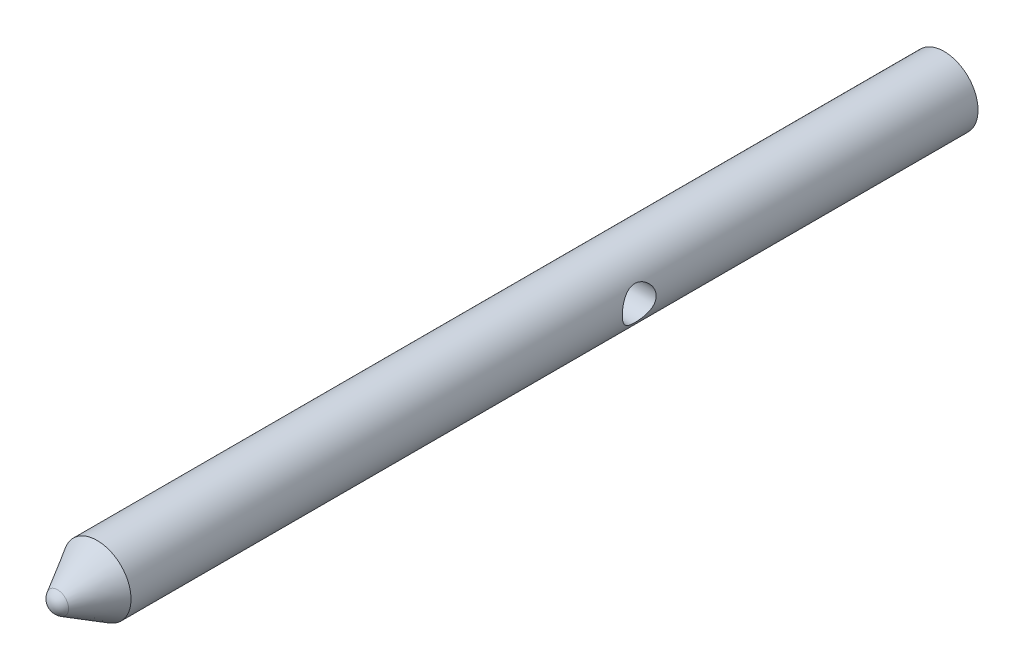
from build123d import *

# Parameters (mm, degrees)
CUT_EXTRUDE1_DEPTH      = 106.579856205
CUT_EXTRUDE1_DEPTH_BACK = 106.579856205
SKETCH5_R               = 2


with BuildPart() as part:
    # Sketch4 → Revolve2 (revolve)
    with BuildSketch(Plane(origin=(0, 0, 0), x_dir=(0, 0, -1), z_dir=(1, 0, 0)), mode=Mode.PRIVATE) as revolve2_sk:
        with BuildLine():
            Line((0, 0), (0, 4))
            Line((0, 4), (-100, 4))
            Line((-100, 4), (-104.67820323, 1.299038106))
            ThreePointArc((-104.67820323, 1.299038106), (-105.227241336, 0.75), (-105.42820323, 0))
            Line((-105.42820323, 0), (0, 0))
        make_face()
    revolve(revolve2_sk.sketch.rotate(Axis((0, 0, -5), (0, 0, 1)), 90), axis=Axis((0, 0, -5), (0, 0, 1)))

    # Sketch5 → Cut-Extrude1 (cut, two sides: drawn at the far end of the back side and taken through both)
    with BuildSketch(Plane(origin=(0, 0, 0), x_dir=(0, 0, -1), z_dir=(1, 0, 0)).offset(-CUT_EXTRUDE1_DEPTH_BACK)):
        with Locations((-40, 0)):
            Circle(SKETCH5_R)
    extrude(amount=CUT_EXTRUDE1_DEPTH + CUT_EXTRUDE1_DEPTH_BACK, mode=Mode.SUBTRACT)


solid = part.part
